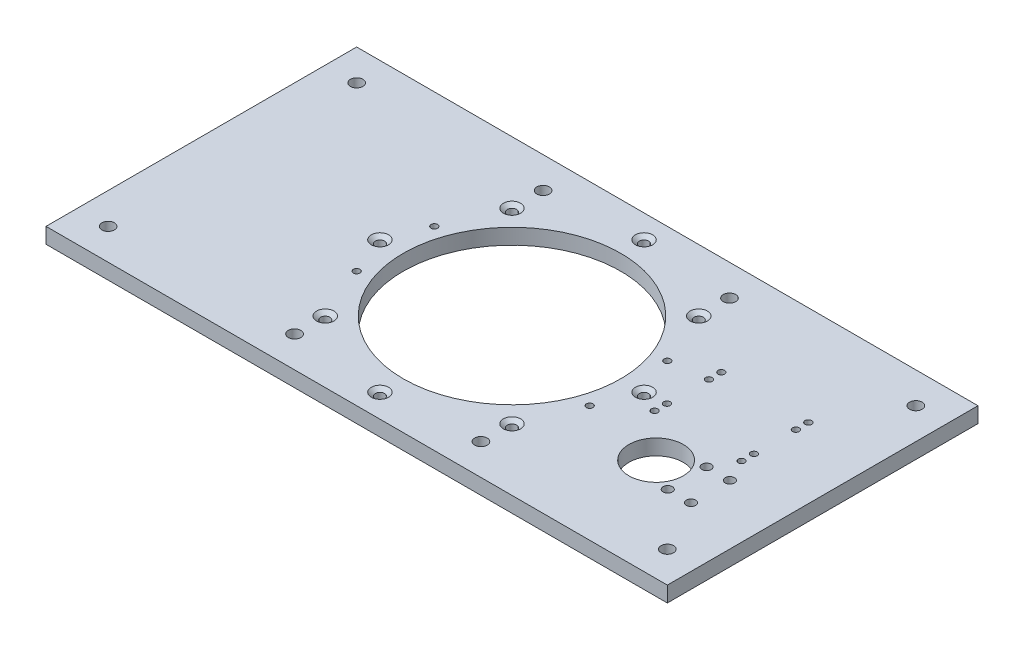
from build123d import *

# Parameters (mm, degrees)
SKETCH1_W                                         = 254
SKETCH1_H                                         = 127
SKETCH1_R                                         = 44.45
EXTRUDE1_DEPTH                                    = 6.35
SKETCH2_R                                         = 11.1125
HOLE_DEPTH                                        = 143.132235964
F_6_CLEARANCE_HOLE1_D                             = 3.7973
F_6_CLEARANCE_HOLE1_DEPTH                         = 78.74
F_6_CLEARANCE_HOLE1_TIP                           = 1.140824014
F_6_32_TAPPED_HOLE1_D                             = 2.7051
LPATTERN1_COUNT                                   = 2
LPATTERN1_PITCH                                   = 22.225
LPATTERN2_COUNT                                   = 4
LPATTERN2_PITCH                                   = 76.2
LPATTERN2_COUNT_DIR2                              = 2
LPATTERN2_PITCH_DIR2                              = 101.6
CSK_FOR_6_FLAT_HEAD_MACHINE_SCREW_100_D           = 3.7973
CSK_FOR_6_FLAT_HEAD_MACHINE_SCREW_100_CSINK_D     = 7.0866
CSK_FOR_6_FLAT_HEAD_MACHINE_SCREW_100_CSINK_ANGLE = 100
CIRPATTERN1_COUNT                                 = 8
F_6_32_TAPPED_HOLE2_D                             = 2.7051


with BuildPart() as part:
    # Sketch1 → Extrude1 (new body)
    with BuildSketch(Plane(origin=(0, 0, 0), x_dir=(1, 0, 0), z_dir=(0, 1, 0))):
        Rectangle(SKETCH1_W, SKETCH1_H)
        with Locations(Location((0, 0, 0), (0, 0, 270))):
            Circle(SKETCH1_R, mode=Mode.SUBTRACT)
    extrude(amount=EXTRUDE1_DEPTH)

    # Sketch2 → hole (cut, through all)
    with BuildSketch(Plane(origin=(0, 6.35, 0), x_dir=(-1, 0, 0), z_dir=(0, 1, 0))):
        with Locations(Location((-80.47321244, 21.562732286, 0), (0, 0, 90))):
            Circle(SKETCH2_R)
    extrude(amount=-HOLE_DEPTH, mode=Mode.SUBTRACT)

    # 6 Clearance Hole1
    with Locations(Plane(origin=(0, 6.35, 0), x_dir=(-1, 0, 0), z_dir=(0, 1, 0))):
        with Locations((-93.17321244, 13.625232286), (-93.17321244, 29.500232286), (-102.69821244, 13.625232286), (-102.69821244, 29.500232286)):
            Hole(F_6_CLEARANCE_HOLE1_D / 2, depth=F_6_CLEARANCE_HOLE1_DEPTH)
            with Locations((0, 0, -(F_6_CLEARANCE_HOLE1_DEPTH + F_6_CLEARANCE_HOLE1_TIP / 2))):  # 118° drill point
                Cone(0, F_6_CLEARANCE_HOLE1_D / 2, F_6_CLEARANCE_HOLE1_TIP, mode=Mode.SUBTRACT)

    # 6-32 Tapped Hole1 (through all)
    with Locations(Plane(origin=(0, 6.35, 0), x_dir=(-1, 0, 0), z_dir=(0, 1, 0))):
        with Locations((-62.69321244, -0.662267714), (-98.25321244, -0.662267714), (-62.69321244, 4.417732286), (-98.25321244, 4.417732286)):
            f_6_32_tapped_hole1 = Hole(F_6_32_TAPPED_HOLE1_D / 2)

    # LPattern1: 6-32 Tapped Hole1 ×2
    with Locations(*[(0, 0, -i * LPATTERN1_PITCH) for i in range(1, LPATTERN1_COUNT)]):
        add(f_6_32_tapped_hole1, mode=Mode.SUBTRACT)

    # Sketch7 → 10 Clearance Hole1 (revolve, cut)
    with BuildSketch(Plane(origin=(114.3, 6.35, 50.8), x_dir=(0, 0, 1), z_dir=(1, 0, 0))):
        Polygon((0, 0), (0, 80.273816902), (2.5527, 78.74), (2.5527, 0), align=None)
    f_10_clearance_hole1 = revolve(axis=Axis((114.3, 12.7, 50.8), (0, -1, 0)), mode=Mode.SUBTRACT)

    # LPattern2: 10 Clearance Hole1 4 × 2
    with Locations(*[(-i * LPATTERN2_PITCH, 0, -j * LPATTERN2_PITCH_DIR2) for i in range(LPATTERN2_COUNT) for j in range(LPATTERN2_COUNT_DIR2) if (i, j) != (0, 0)]):
        add(f_10_clearance_hole1, mode=Mode.SUBTRACT)

    # CSK for _6 Flat Head Machine Screw _100 (through all)
    with Locations(Plane(origin=(0, 6.35, 0), x_dir=(-1, 0, 0), z_dir=(0, 1, 0))):
        with Locations((0, 53.975)):
            csk_for_6_flat_head_machine_screw_100 = CounterSinkHole(CSK_FOR_6_FLAT_HEAD_MACHINE_SCREW_100_D / 2, CSK_FOR_6_FLAT_HEAD_MACHINE_SCREW_100_CSINK_D / 2, counter_sink_angle=CSK_FOR_6_FLAT_HEAD_MACHINE_SCREW_100_CSINK_ANGLE)

    # CirPattern1: CSK for _6 Flat Head Machine Screw _100 ×8 about axis
    cirpattern1_axis = Axis((0, 0, 0), (0, 1, 0))
    for i in range(1, CIRPATTERN1_COUNT):
        add(csk_for_6_flat_head_machine_screw_100.rotate(cirpattern1_axis, i * 360 / CIRPATTERN1_COUNT), mode=Mode.SUBTRACT)

    # 6-32 Tapped Hole2 (through all)
    with Locations(Plane(origin=(0, 6.35, 0), x_dir=(-1, 0, 0), z_dir=(0, 1, 0))):
        with Locations((-47.625, 15.875), (-47.625, -15.875), (47.625, -15.875), (47.625, 15.875)):
            Hole(F_6_32_TAPPED_HOLE2_D / 2)


solid = part.part
